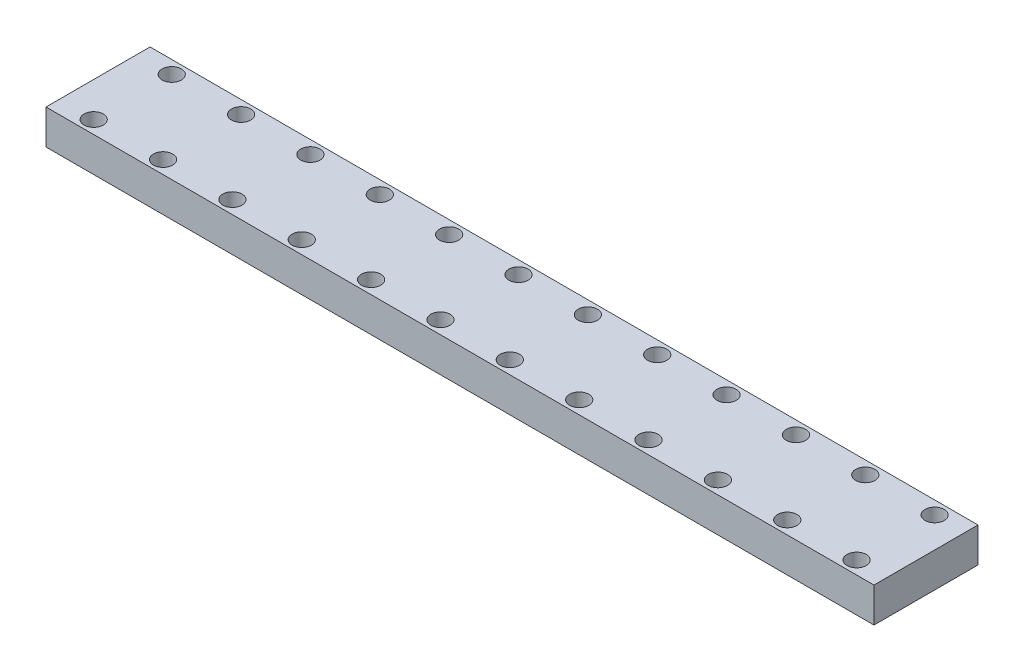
from build123d import *

# Parameters (mm, degrees)
SKETCH_1_W      = 191
SKETCH_1_H      = 24
SKETCH_1_R      = 2.222124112
EXTRUDE_1_DEPTH = 8


with BuildPart() as part:
    # Sketch 1 → Extrude 1 (new body)
    with BuildSketch(Plane(origin=(0, 0, 0), x_dir=(1, 0, 0), z_dir=(0, 1, 0))):
        with Locations((72.785714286, -1.428571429)):
            Rectangle(SKETCH_1_W, SKETCH_1_H)
        with Locations(Location((-14.714285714, 7.571428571, 0), (0, 0, 270))):
            Circle(SKETCH_1_R, mode=Mode.SUBTRACT)
        with Locations(Location((1.285714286, 7.571428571, 0), (0, 0, 270))):
            Circle(SKETCH_1_R, mode=Mode.SUBTRACT)
        with Locations(Location((17.285714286, 7.571428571, 0), (0, 0, 270))):
            Circle(SKETCH_1_R, mode=Mode.SUBTRACT)
        with Locations(Location((33.285714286, 7.571428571, 0), (0, 0, 270))):
            Circle(SKETCH_1_R, mode=Mode.SUBTRACT)
        with Locations(Location((49.285714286, 7.571428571, 0), (0, 0, 270))):
            Circle(SKETCH_1_R, mode=Mode.SUBTRACT)
        with Locations(Location((65.285714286, 7.571428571, 0), (0, 0, 270))):
            Circle(SKETCH_1_R, mode=Mode.SUBTRACT)
        with Locations(Location((81.285714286, 7.571428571, 0), (0, 0, 270))):
            Circle(SKETCH_1_R, mode=Mode.SUBTRACT)
        with Locations(Location((97.285714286, 7.571428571, 0), (0, 0, 270))):
            Circle(SKETCH_1_R, mode=Mode.SUBTRACT)
        with Locations(Location((113.285714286, 7.571428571, 0), (0, 0, 270))):
            Circle(SKETCH_1_R, mode=Mode.SUBTRACT)
        with Locations(Location((129.285714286, 7.571428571, 0), (0, 0, 270))):
            Circle(SKETCH_1_R, mode=Mode.SUBTRACT)
        with Locations(Location((145.285714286, 7.571428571, 0), (0, 0, 270))):
            Circle(SKETCH_1_R, mode=Mode.SUBTRACT)
        with Locations(Location((161.285714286, 7.571428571, 0), (0, 0, 270))):
            Circle(SKETCH_1_R, mode=Mode.SUBTRACT)
        with Locations(Location((-14.714285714, -10.428571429, 0), (0, 0, 270))):
            Circle(SKETCH_1_R, mode=Mode.SUBTRACT)
        with Locations(Location((1.285714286, -10.428571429, 0), (0, 0, 270))):
            Circle(SKETCH_1_R, mode=Mode.SUBTRACT)
        with Locations(Location((17.285714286, -10.428571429, 0), (0, 0, 270))):
            Circle(SKETCH_1_R, mode=Mode.SUBTRACT)
        with Locations(Location((33.285714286, -10.428571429, 0), (0, 0, 270))):
            Circle(SKETCH_1_R, mode=Mode.SUBTRACT)
        with Locations(Location((49.285714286, -10.428571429, 0), (0, 0, 270))):
            Circle(SKETCH_1_R, mode=Mode.SUBTRACT)
        with Locations(Location((65.285714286, -10.428571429, 0), (0, 0, 270))):
            Circle(SKETCH_1_R, mode=Mode.SUBTRACT)
        with Locations(Location((81.285714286, -10.428571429, 0), (0, 0, 270))):
            Circle(SKETCH_1_R, mode=Mode.SUBTRACT)
        with Locations(Location((97.285714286, -10.428571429, 0), (0, 0, 270))):
            Circle(SKETCH_1_R, mode=Mode.SUBTRACT)
        with Locations(Location((113.285714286, -10.428571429, 0), (0, 0, 270))):
            Circle(SKETCH_1_R, mode=Mode.SUBTRACT)
        with Locations(Location((129.285714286, -10.428571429, 0), (0, 0, 270))):
            Circle(SKETCH_1_R, mode=Mode.SUBTRACT)
        with Locations(Location((145.285714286, -10.428571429, 0), (0, 0, 270))):
            Circle(SKETCH_1_R, mode=Mode.SUBTRACT)
        with Locations(Location((161.285714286, -10.428571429, 0), (0, 0, 270))):
            Circle(SKETCH_1_R, mode=Mode.SUBTRACT)
    extrude(amount=EXTRUDE_1_DEPTH)


solid = part.part
